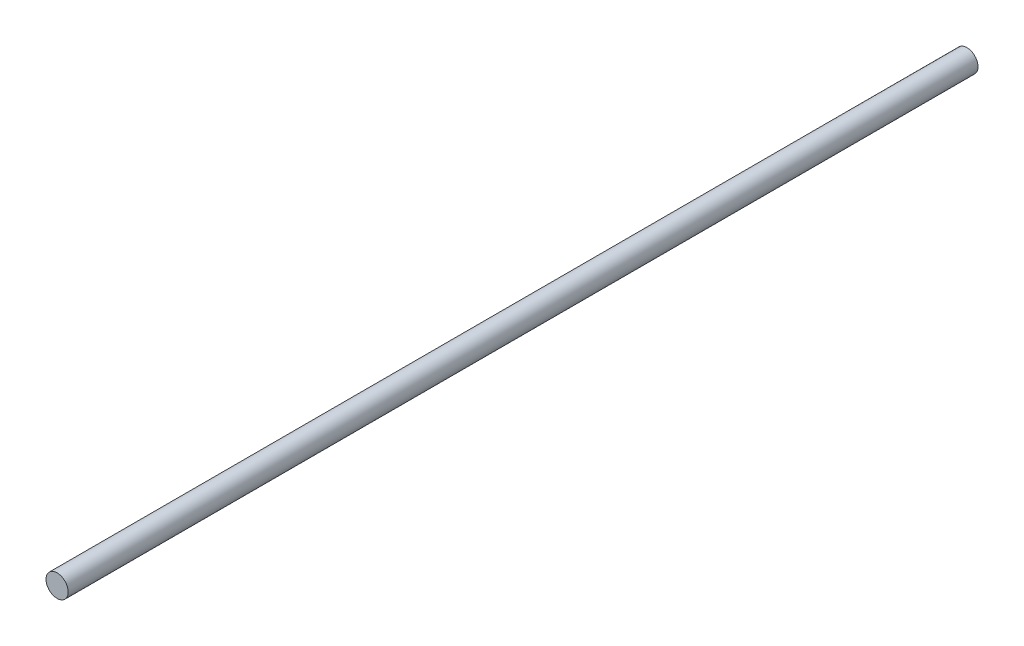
from build123d import *

# Parameters (mm, degrees)
CROQUIS1_W = 410
CROQUIS1_H = 5


with BuildPart() as part:
    # Croquis1 → Revoluci_n1 (revolve)
    with BuildSketch(Plane(origin=(0, 0, 0), x_dir=(0, 0, -1), z_dir=(1, 0, 0)), mode=Mode.PRIVATE) as revoluci_n1_sk:
        with Locations((0, 2.5)):
            Rectangle(CROQUIS1_W, CROQUIS1_H)
    revolve(revoluci_n1_sk.sketch.rotate(Axis((0, 0, 226.798346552), (0, 0, -1)), 180), axis=Axis((0, 0, 226.798346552), (0, 0, -1)))


solid = part.part
